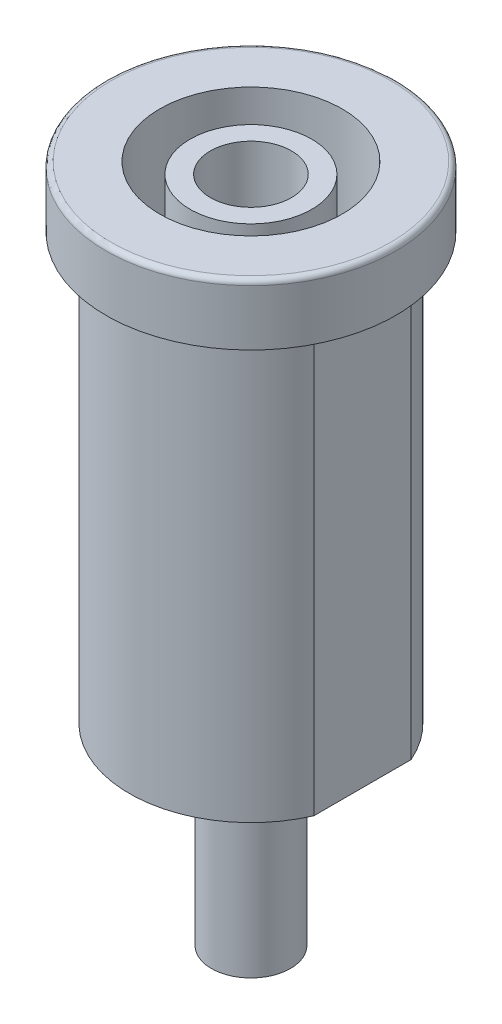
ISO-10303-21;
HEADER;
FILE_DESCRIPTION(('STEP AP214'),'2;1');
FILE_NAME('part.step','',(''),(''),'','','');
FILE_SCHEMA(('AUTOMOTIVE_DESIGN { 1 0 10303 214 1 1 1 1 }'));
ENDSEC;
DATA;
#1=APPLICATION_CONTEXT('core data for automotive mechanical design processes');
#2=APPLICATION_PROTOCOL_DEFINITION('international standard','automotive_design',2000,#1);
#3=PRODUCT_CONTEXT('',#1,'mechanical');
#4=PRODUCT('Part','Part','',(#3));
#5=PRODUCT_RELATED_PRODUCT_CATEGORY('part','',(#4));
#6=PRODUCT_DEFINITION_FORMATION('','',#4);
#7=PRODUCT_DEFINITION_CONTEXT('part definition',#1,'design');
#8=PRODUCT_DEFINITION('design','',#6,#7);
#9=PRODUCT_DEFINITION_SHAPE('','',#8);
#10=(LENGTH_UNIT() NAMED_UNIT(*) SI_UNIT(.MILLI.,.METRE.));
#11=(NAMED_UNIT(*) PLANE_ANGLE_UNIT() SI_UNIT($,.RADIAN.));
#12=(NAMED_UNIT(*) SI_UNIT($,.STERADIAN.) SOLID_ANGLE_UNIT());
#13=UNCERTAINTY_MEASURE_WITH_UNIT(LENGTH_MEASURE(1.E-05),#10,'distance_accuracy_value','');
#14=(GEOMETRIC_REPRESENTATION_CONTEXT(3) GLOBAL_UNCERTAINTY_ASSIGNED_CONTEXT((#13)) GLOBAL_UNIT_ASSIGNED_CONTEXT((#10,
#11,#12)) REPRESENTATION_CONTEXT('',''));
#15=CARTESIAN_POINT('',(0.,0.,0.));
#16=DIRECTION('',(0.,0.,1.));
#17=DIRECTION('',(1.,0.,0.));
#18=AXIS2_PLACEMENT_3D('',#15,#16,#17);
#19=CARTESIAN_POINT('',(0.,5.96418265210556,0.));
#20=DIRECTION('',(0.,1.,0.));
#21=DIRECTION('',(-1.,0.,0.));
#22=AXIS2_PLACEMENT_3D('',#19,#20,#21);
#23=CYLINDRICAL_SURFACE('',#22,6.);
#24=DIRECTION('',(0.,1.,0.));
#25=VECTOR('',#24,1.);
#26=CARTESIAN_POINT('',(-5.5,5.96418265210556,-2.39791576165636));
#27=LINE('',#26,#25);
#28=CARTESIAN_POINT('',(-5.5,4.60249711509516,-2.39791576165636));
#29=VERTEX_POINT('',#28);
#30=CARTESIAN_POINT('',(-5.5,-16.3975028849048,-2.39791576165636));
#31=VERTEX_POINT('',#30);
#32=EDGE_CURVE('E131',#29,#31,#27,.F.);
#33=ORIENTED_EDGE('',*,*,#32,.F.);
#34=CARTESIAN_POINT('',(0.,4.60249711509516,0.));
#35=DIRECTION('',(0.,1.,0.));
#36=DIRECTION('',(-1.,0.,0.));
#37=AXIS2_PLACEMENT_3D('',#34,#35,#36);
#38=CIRCLE('',#37,6.);
#39=CARTESIAN_POINT('',(5.5,4.60249711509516,-2.39791576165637));
#40=VERTEX_POINT('',#39);
#41=EDGE_CURVE('E98',#40,#29,#38,.T.);
#42=ORIENTED_EDGE('',*,*,#41,.F.);
#43=DIRECTION('',(0.,1.,0.));
#44=VECTOR('',#43,1.);
#45=CARTESIAN_POINT('',(5.5,5.96418265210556,-2.39791576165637));
#46=LINE('',#45,#44);
#47=CARTESIAN_POINT('',(5.5,-16.3975028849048,-2.39791576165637));
#48=VERTEX_POINT('',#47);
#49=EDGE_CURVE('E81',#48,#40,#46,.T.);
#50=ORIENTED_EDGE('',*,*,#49,.F.);
#51=CARTESIAN_POINT('',(0.,-16.3975028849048,0.));
#52=DIRECTION('',(0.,1.,0.));
#53=DIRECTION('',(-1.,0.,0.));
#54=AXIS2_PLACEMENT_3D('',#51,#52,#53);
#55=CIRCLE('',#54,6.);
#56=EDGE_CURVE('E97',#48,#31,#55,.T.);
#57=ORIENTED_EDGE('',*,*,#56,.T.);
#58=EDGE_LOOP('',(#33,#42,#50,#57));
#59=FACE_BOUND('',#58,.T.);
#60=ADVANCED_FACE('F37',(#59),#23,.T.);
#61=CARTESIAN_POINT('',(0.,-16.3975028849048,0.));
#62=DIRECTION('',(0.,-1.,0.));
#63=DIRECTION('',(1.,0.,0.));
#64=AXIS2_PLACEMENT_3D('',#61,#62,#63);
#65=PLANE('',#64);
#66=DIRECTION('',(0.,0.,1.));
#67=VECTOR('',#66,1.);
#68=CARTESIAN_POINT('',(-5.5,-16.3975028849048,6.41049670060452));
#69=LINE('',#68,#67);
#70=CARTESIAN_POINT('',(-5.5,-16.3975028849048,2.39791576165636));
#71=VERTEX_POINT('',#70);
#72=EDGE_CURVE('E83',#31,#71,#69,.T.);
#73=ORIENTED_EDGE('',*,*,#72,.F.);
#74=ORIENTED_EDGE('',*,*,#56,.F.);
#75=DIRECTION('',(0.,0.,-1.));
#76=VECTOR('',#75,1.);
#77=CARTESIAN_POINT('',(5.5,-16.3975028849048,6.9871530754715));
#78=LINE('',#77,#76);
#79=CARTESIAN_POINT('',(5.5,-16.3975028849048,2.39791576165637));
#80=VERTEX_POINT('',#79);
#81=EDGE_CURVE('E84',#80,#48,#78,.T.);
#82=ORIENTED_EDGE('',*,*,#81,.F.);
#83=EDGE_CURVE('E41',#71,#80,#55,.T.);
#84=ORIENTED_EDGE('',*,*,#83,.F.);
#85=EDGE_LOOP('',(#73,#74,#82,#84));
#86=FACE_BOUND('',#85,.T.);
#87=CARTESIAN_POINT('',(0.,-16.3975028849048,0.));
#88=DIRECTION('',(0.,-1.,0.));
#89=DIRECTION('',(1.,0.,0.));
#90=AXIS2_PLACEMENT_3D('',#87,#88,#89);
#91=CIRCLE('',#90,1.95);
#92=CARTESIAN_POINT('',(1.95,-16.3975028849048,0.));
#93=VERTEX_POINT('',#92);
#94=EDGE_CURVE('E11',#93,#93,#91,.T.);
#95=ORIENTED_EDGE('',*,*,#94,.F.);
#96=EDGE_LOOP('',(#95));
#97=FACE_BOUND('',#96,.T.);
#98=ADVANCED_FACE('F39',(#86,#97),#65,.T.);
#99=DIRECTION('',(0.,1.,0.));
#100=VECTOR('',#99,1.);
#101=CARTESIAN_POINT('',(-5.5,5.96418265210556,2.39791576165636));
#102=LINE('',#101,#100);
#103=CARTESIAN_POINT('',(-5.5,4.60249711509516,2.39791576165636));
#104=VERTEX_POINT('',#103);
#105=EDGE_CURVE('E93',#71,#104,#102,.T.);
#106=ORIENTED_EDGE('',*,*,#105,.F.);
#107=ORIENTED_EDGE('',*,*,#83,.T.);
#108=DIRECTION('',(0.,1.,0.));
#109=VECTOR('',#108,1.);
#110=CARTESIAN_POINT('',(5.5,5.96418265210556,2.39791576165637));
#111=LINE('',#110,#109);
#112=CARTESIAN_POINT('',(5.5,4.60249711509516,2.39791576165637));
#113=VERTEX_POINT('',#112);
#114=EDGE_CURVE('E78',#113,#80,#111,.F.);
#115=ORIENTED_EDGE('',*,*,#114,.F.);
#116=EDGE_CURVE('E91',#104,#113,#38,.T.);
#117=ORIENTED_EDGE('',*,*,#116,.F.);
#118=EDGE_LOOP('',(#106,#107,#115,#117));
#119=FACE_BOUND('',#118,.T.);
#120=ADVANCED_FACE('F90',(#119),#23,.T.);
#121=CARTESIAN_POINT('',(-6.,4.60249711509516,0.));
#122=DIRECTION('',(0.,-1.,0.));
#123=DIRECTION('',(1.,0.,0.));
#124=AXIS2_PLACEMENT_3D('',#121,#122,#123);
#125=PLANE('',#124);
#126=ORIENTED_EDGE('',*,*,#41,.T.);
#127=DIRECTION('',(0.,0.,-1.));
#128=VECTOR('',#127,1.);
#129=CARTESIAN_POINT('',(-5.5,4.60249711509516,6.41049670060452));
#130=LINE('',#129,#128);
#131=EDGE_CURVE('E58',#104,#29,#130,.T.);
#132=ORIENTED_EDGE('',*,*,#131,.F.);
#133=ORIENTED_EDGE('',*,*,#116,.T.);
#134=DIRECTION('',(0.,0.,1.));
#135=VECTOR('',#134,1.);
#136=CARTESIAN_POINT('',(5.5,4.60249711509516,6.9871530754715));
#137=LINE('',#136,#135);
#138=EDGE_CURVE('E53',#40,#113,#137,.T.);
#139=ORIENTED_EDGE('',*,*,#138,.F.);
#140=EDGE_LOOP('',(#126,#132,#133,#139));
#141=FACE_BOUND('',#140,.T.);
#142=CARTESIAN_POINT('',(0.,4.60249711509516,0.));
#143=DIRECTION('',(0.,1.,0.));
#144=DIRECTION('',(-1.,0.,0.));
#145=AXIS2_PLACEMENT_3D('',#142,#143,#144);
#146=CIRCLE('',#145,7.15);
#147=CARTESIAN_POINT('',(-7.15,4.60249711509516,0.));
#148=VERTEX_POINT('',#147);
#149=EDGE_CURVE('E100',#148,#148,#146,.T.);
#150=ORIENTED_EDGE('',*,*,#149,.F.);
#151=EDGE_LOOP('',(#150));
#152=FACE_BOUND('',#151,.T.);
#153=ADVANCED_FACE('F95',(#141,#152),#125,.T.);
#154=CARTESIAN_POINT('',(0.,5.96418265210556,0.));
#155=DIRECTION('',(0.,1.,0.));
#156=DIRECTION('',(-1.,0.,0.));
#157=AXIS2_PLACEMENT_3D('',#154,#155,#156);
#158=CYLINDRICAL_SURFACE('',#157,7.15);
#159=ORIENTED_EDGE('',*,*,#149,.T.);
#160=EDGE_LOOP('',(#159));
#161=FACE_BOUND('',#160,.T.);
#162=CARTESIAN_POINT('',(0.,7.35249711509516,0.));
#163=DIRECTION('',(0.,1.,0.));
#164=DIRECTION('',(-1.,0.,0.));
#165=AXIS2_PLACEMENT_3D('',#162,#163,#164);
#166=CIRCLE('',#165,7.15);
#167=CARTESIAN_POINT('',(-7.15,7.35249711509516,0.));
#168=VERTEX_POINT('',#167);
#169=EDGE_CURVE('E104',#168,#168,#166,.T.);
#170=ORIENTED_EDGE('',*,*,#169,.F.);
#171=EDGE_LOOP('',(#170));
#172=FACE_BOUND('',#171,.T.);
#173=ADVANCED_FACE('F174',(#161,#172),#158,.T.);
#174=CARTESIAN_POINT('',(0.,7.35249711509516,0.));
#175=DIRECTION('',(0.,1.,0.));
#176=DIRECTION('',(-1.,0.,0.));
#177=AXIS2_PLACEMENT_3D('',#174,#175,#176);
#178=TOROIDAL_SURFACE('',#177,6.9,0.25);
#179=ORIENTED_EDGE('',*,*,#169,.T.);
#180=EDGE_LOOP('',(#179));
#181=FACE_BOUND('',#180,.T.);
#182=CARTESIAN_POINT('',(0.,7.60249711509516,0.));
#183=DIRECTION('',(0.,1.,0.));
#184=DIRECTION('',(-1.,0.,0.));
#185=AXIS2_PLACEMENT_3D('',#182,#183,#184);
#186=CIRCLE('',#185,6.9);
#187=CARTESIAN_POINT('',(-6.9,7.60249711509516,0.));
#188=VERTEX_POINT('',#187);
#189=EDGE_CURVE('E107',#188,#188,#186,.T.);
#190=ORIENTED_EDGE('',*,*,#189,.F.);
#191=EDGE_LOOP('',(#190));
#192=FACE_BOUND('',#191,.T.);
#193=ADVANCED_FACE('F179',(#181,#192),#178,.T.);
#194=CARTESIAN_POINT('',(-6.9,7.60249711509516,0.));
#195=DIRECTION('',(0.,1.,0.));
#196=DIRECTION('',(-1.,0.,0.));
#197=AXIS2_PLACEMENT_3D('',#194,#195,#196);
#198=PLANE('',#197);
#199=ORIENTED_EDGE('',*,*,#189,.T.);
#200=EDGE_LOOP('',(#199));
#201=FACE_BOUND('',#200,.T.);
#202=CARTESIAN_POINT('',(0.,7.60249711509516,0.));
#203=DIRECTION('',(0.,1.,0.));
#204=DIRECTION('',(-1.,0.,0.));
#205=AXIS2_PLACEMENT_3D('',#202,#203,#204);
#206=CIRCLE('',#205,4.5);
#207=CARTESIAN_POINT('',(-4.5,7.60249711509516,0.));
#208=VERTEX_POINT('',#207);
#209=EDGE_CURVE('E110',#208,#208,#206,.T.);
#210=ORIENTED_EDGE('',*,*,#209,.F.);
#211=EDGE_LOOP('',(#210));
#212=FACE_BOUND('',#211,.T.);
#213=ADVANCED_FACE('F185',(#201,#212),#198,.T.);
#214=CARTESIAN_POINT('',(0.,5.96418265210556,0.));
#215=DIRECTION('',(0.,1.,0.));
#216=DIRECTION('',(-1.,0.,0.));
#217=AXIS2_PLACEMENT_3D('',#214,#215,#216);
#218=CYLINDRICAL_SURFACE('',#217,4.5);
#219=ORIENTED_EDGE('',*,*,#209,.T.);
#220=EDGE_LOOP('',(#219));
#221=FACE_BOUND('',#220,.T.);
#222=CARTESIAN_POINT('',(0.,-14.3975028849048,0.));
#223=DIRECTION('',(0.,1.,0.));
#224=DIRECTION('',(-1.,0.,0.));
#225=AXIS2_PLACEMENT_3D('',#222,#223,#224);
#226=CIRCLE('',#225,4.5);
#227=CARTESIAN_POINT('',(-4.5,-14.3975028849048,0.));
#228=VERTEX_POINT('',#227);
#229=EDGE_CURVE('E113',#228,#228,#226,.T.);
#230=ORIENTED_EDGE('',*,*,#229,.F.);
#231=EDGE_LOOP('',(#230));
#232=FACE_BOUND('',#231,.T.);
#233=ADVANCED_FACE('F189',(#221,#232),#218,.F.);
#234=CARTESIAN_POINT('',(-4.5,-14.3975028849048,0.));
#235=DIRECTION('',(0.,1.,0.));
#236=DIRECTION('',(-1.,0.,0.));
#237=AXIS2_PLACEMENT_3D('',#234,#235,#236);
#238=PLANE('',#237);
#239=ORIENTED_EDGE('',*,*,#229,.T.);
#240=EDGE_LOOP('',(#239));
#241=FACE_BOUND('',#240,.T.);
#242=CARTESIAN_POINT('',(0.,-14.3975028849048,0.));
#243=DIRECTION('',(0.,1.,0.));
#244=DIRECTION('',(-1.,0.,0.));
#245=AXIS2_PLACEMENT_3D('',#242,#243,#244);
#246=CIRCLE('',#245,3.);
#247=CARTESIAN_POINT('',(-3.,-14.3975028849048,0.));
#248=VERTEX_POINT('',#247);
#249=EDGE_CURVE('E116',#248,#248,#246,.T.);
#250=ORIENTED_EDGE('',*,*,#249,.F.);
#251=EDGE_LOOP('',(#250));
#252=FACE_BOUND('',#251,.T.);
#253=ADVANCED_FACE('F193',(#241,#252),#238,.T.);
#254=CARTESIAN_POINT('',(0.,5.96418265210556,0.));
#255=DIRECTION('',(0.,1.,0.));
#256=DIRECTION('',(-1.,0.,0.));
#257=AXIS2_PLACEMENT_3D('',#254,#255,#256);
#258=CYLINDRICAL_SURFACE('',#257,3.);
#259=ORIENTED_EDGE('',*,*,#249,.T.);
#260=EDGE_LOOP('',(#259));
#261=FACE_BOUND('',#260,.T.);
#262=CARTESIAN_POINT('',(0.,7.057822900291,0.));
#263=DIRECTION('',(0.,1.,0.));
#264=DIRECTION('',(-1.,0.,0.));
#265=AXIS2_PLACEMENT_3D('',#262,#263,#264);
#266=CIRCLE('',#265,3.);
#267=CARTESIAN_POINT('',(-3.,7.057822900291,0.));
#268=VERTEX_POINT('',#267);
#269=EDGE_CURVE('E119',#268,#268,#266,.T.);
#270=ORIENTED_EDGE('',*,*,#269,.F.);
#271=EDGE_LOOP('',(#270));
#272=FACE_BOUND('',#271,.T.);
#273=ADVANCED_FACE('F197',(#261,#272),#258,.T.);
#274=CARTESIAN_POINT('',(-3.,7.057822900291,0.));
#275=DIRECTION('',(0.,1.,0.));
#276=DIRECTION('',(-1.,0.,0.));
#277=AXIS2_PLACEMENT_3D('',#274,#275,#276);
#278=PLANE('',#277);
#279=ORIENTED_EDGE('',*,*,#269,.T.);
#280=EDGE_LOOP('',(#279));
#281=FACE_BOUND('',#280,.T.);
#282=CARTESIAN_POINT('',(0.,7.057822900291,0.));
#283=DIRECTION('',(0.,1.,0.));
#284=DIRECTION('',(-1.,0.,0.));
#285=AXIS2_PLACEMENT_3D('',#282,#283,#284);
#286=CIRCLE('',#285,2.);
#287=CARTESIAN_POINT('',(-2.,7.057822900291,0.));
#288=VERTEX_POINT('',#287);
#289=EDGE_CURVE('E122',#288,#288,#286,.T.);
#290=ORIENTED_EDGE('',*,*,#289,.F.);
#291=EDGE_LOOP('',(#290));
#292=FACE_BOUND('',#291,.T.);
#293=ADVANCED_FACE('F201',(#281,#292),#278,.T.);
#294=CARTESIAN_POINT('',(0.,5.96418265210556,0.));
#295=DIRECTION('',(0.,1.,0.));
#296=DIRECTION('',(-1.,0.,0.));
#297=AXIS2_PLACEMENT_3D('',#294,#295,#296);
#298=CYLINDRICAL_SURFACE('',#297,2.);
#299=ORIENTED_EDGE('',*,*,#289,.T.);
#300=EDGE_LOOP('',(#299));
#301=FACE_BOUND('',#300,.T.);
#302=CARTESIAN_POINT('',(0.,-12.3975028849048,0.));
#303=DIRECTION('',(0.,1.,0.));
#304=DIRECTION('',(-1.,0.,0.));
#305=AXIS2_PLACEMENT_3D('',#302,#303,#304);
#306=CIRCLE('',#305,2.);
#307=CARTESIAN_POINT('',(-2.,-12.3975028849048,0.));
#308=VERTEX_POINT('',#307);
#309=EDGE_CURVE('E125',#308,#308,#306,.T.);
#310=ORIENTED_EDGE('',*,*,#309,.F.);
#311=EDGE_LOOP('',(#310));
#312=FACE_BOUND('',#311,.T.);
#313=ADVANCED_FACE('F160',(#301,#312),#298,.F.);
#314=CARTESIAN_POINT('',(-2.,-12.3975028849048,0.));
#315=DIRECTION('',(0.,1.,0.));
#316=DIRECTION('',(-1.,0.,0.));
#317=AXIS2_PLACEMENT_3D('',#314,#315,#316);
#318=PLANE('',#317);
#319=ORIENTED_EDGE('',*,*,#309,.T.);
#320=EDGE_LOOP('',(#319));
#321=FACE_BOUND('',#320,.T.);
#322=ADVANCED_FACE('F151',(#321),#318,.T.);
#323=CARTESIAN_POINT('',(0.,-25.8975028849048,0.));
#324=DIRECTION('',(0.,1.,0.));
#325=DIRECTION('',(-1.,0.,0.));
#326=AXIS2_PLACEMENT_3D('',#323,#324,#325);
#327=CYLINDRICAL_SURFACE('',#326,1.95);
#328=CARTESIAN_POINT('',(0.,-25.8975028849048,0.));
#329=DIRECTION('',(0.,-1.,0.));
#330=DIRECTION('',(1.,0.,0.));
#331=AXIS2_PLACEMENT_3D('',#328,#329,#330);
#332=CIRCLE('',#331,1.95);
#333=CARTESIAN_POINT('',(1.95,-25.8975028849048,0.));
#334=VERTEX_POINT('',#333);
#335=EDGE_CURVE('E127',#334,#334,#332,.T.);
#336=ORIENTED_EDGE('',*,*,#335,.F.);
#337=EDGE_LOOP('',(#336));
#338=FACE_BOUND('',#337,.T.);
#339=ORIENTED_EDGE('',*,*,#94,.T.);
#340=EDGE_LOOP('',(#339));
#341=FACE_BOUND('',#340,.T.);
#342=ADVANCED_FACE('F148',(#338,#341),#327,.T.);
#343=CARTESIAN_POINT('',(0.,-25.8975028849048,0.));
#344=DIRECTION('',(0.,-1.,0.));
#345=DIRECTION('',(1.,0.,0.));
#346=AXIS2_PLACEMENT_3D('',#343,#344,#345);
#347=PLANE('',#346);
#348=ORIENTED_EDGE('',*,*,#335,.T.);
#349=EDGE_LOOP('',(#348));
#350=FACE_BOUND('',#349,.T.);
#351=ADVANCED_FACE('F150',(#350),#347,.T.);
#352=CARTESIAN_POINT('',(5.5,19.9643266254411,6.9871530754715));
#353=DIRECTION('',(-1.,0.,0.));
#354=DIRECTION('',(0.,-1.,0.));
#355=AXIS2_PLACEMENT_3D('',#352,#353,#354);
#356=PLANE('',#355);
#357=ORIENTED_EDGE('',*,*,#114,.T.);
#358=ORIENTED_EDGE('',*,*,#81,.T.);
#359=ORIENTED_EDGE('',*,*,#49,.T.);
#360=ORIENTED_EDGE('',*,*,#138,.T.);
#361=EDGE_LOOP('',(#357,#358,#359,#360));
#362=FACE_BOUND('',#361,.T.);
#363=ADVANCED_FACE('F77',(#362),#356,.F.);
#364=CARTESIAN_POINT('',(-5.5,19.9643266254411,6.41049670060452));
#365=DIRECTION('',(1.,0.,0.));
#366=DIRECTION('',(0.,0.,-1.));
#367=AXIS2_PLACEMENT_3D('',#364,#365,#366);
#368=PLANE('',#367);
#369=ORIENTED_EDGE('',*,*,#32,.T.);
#370=ORIENTED_EDGE('',*,*,#72,.T.);
#371=ORIENTED_EDGE('',*,*,#105,.T.);
#372=ORIENTED_EDGE('',*,*,#131,.T.);
#373=EDGE_LOOP('',(#369,#370,#371,#372));
#374=FACE_BOUND('',#373,.T.);
#375=ADVANCED_FACE('F139',(#374),#368,.F.);
#376=CLOSED_SHELL('',(#60,#98,#120,#153,#173,#193,#213,#233,#253,#273,#293,#313,#322,#342,#351,
#363,#375));
#377=MANIFOLD_SOLID_BREP('B2',#376);
#378=ADVANCED_BREP_SHAPE_REPRESENTATION('',(#18,#377),#14);
#379=SHAPE_DEFINITION_REPRESENTATION(#9,#378);
ENDSEC;
END-ISO-10303-21;
